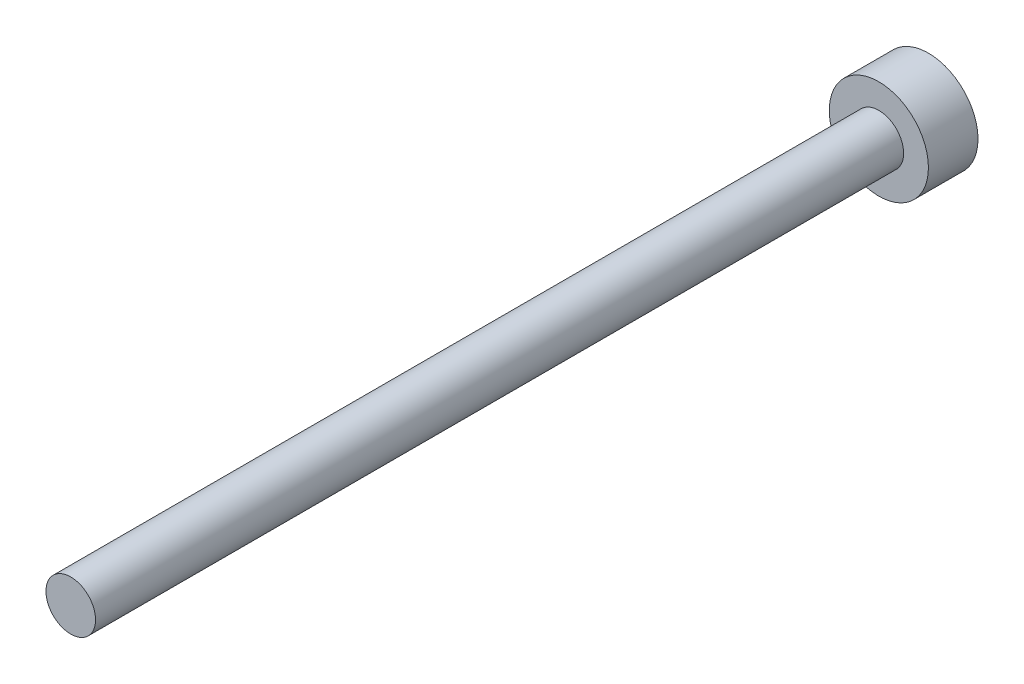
ISO-10303-21;
HEADER;
FILE_DESCRIPTION(('STEP AP214'),'2;1');
FILE_NAME('part.step','',(''),(''),'','','');
FILE_SCHEMA(('AUTOMOTIVE_DESIGN { 1 0 10303 214 1 1 1 1 }'));
ENDSEC;
DATA;
#1=APPLICATION_CONTEXT('core data for automotive mechanical design processes');
#2=APPLICATION_PROTOCOL_DEFINITION('international standard','automotive_design',2000,#1);
#3=PRODUCT_CONTEXT('',#1,'mechanical');
#4=PRODUCT('Part','Part','',(#3));
#5=PRODUCT_RELATED_PRODUCT_CATEGORY('part','',(#4));
#6=PRODUCT_DEFINITION_FORMATION('','',#4);
#7=PRODUCT_DEFINITION_CONTEXT('part definition',#1,'design');
#8=PRODUCT_DEFINITION('design','',#6,#7);
#9=PRODUCT_DEFINITION_SHAPE('','',#8);
#10=(LENGTH_UNIT() NAMED_UNIT(*) SI_UNIT(.MILLI.,.METRE.));
#11=(NAMED_UNIT(*) PLANE_ANGLE_UNIT() SI_UNIT($,.RADIAN.));
#12=(NAMED_UNIT(*) SI_UNIT($,.STERADIAN.) SOLID_ANGLE_UNIT());
#13=UNCERTAINTY_MEASURE_WITH_UNIT(LENGTH_MEASURE(1.E-05),#10,'distance_accuracy_value','');
#14=(GEOMETRIC_REPRESENTATION_CONTEXT(3) GLOBAL_UNCERTAINTY_ASSIGNED_CONTEXT((#13)) GLOBAL_UNIT_ASSIGNED_CONTEXT((#10,
#11,#12)) REPRESENTATION_CONTEXT('',''));
#15=CARTESIAN_POINT('',(0.,0.,0.));
#16=DIRECTION('',(0.,0.,1.));
#17=DIRECTION('',(1.,0.,0.));
#18=AXIS2_PLACEMENT_3D('',#15,#16,#17);
#19=CARTESIAN_POINT('',(0.,0.,2.));
#20=DIRECTION('',(0.,0.,1.));
#21=DIRECTION('',(1.,0.,0.));
#22=AXIS2_PLACEMENT_3D('',#19,#20,#21);
#23=PLANE('',#22);
#24=CARTESIAN_POINT('',(0.,0.,2.));
#25=DIRECTION('',(0.,0.,1.));
#26=DIRECTION('',(1.,0.,0.));
#27=AXIS2_PLACEMENT_3D('',#24,#25,#26);
#28=CIRCLE('',#27,2.);
#29=CARTESIAN_POINT('',(2.,0.,2.));
#30=VERTEX_POINT('',#29);
#31=EDGE_CURVE('E10',#30,#30,#28,.T.);
#32=ORIENTED_EDGE('',*,*,#31,.T.);
#33=EDGE_LOOP('',(#32));
#34=FACE_BOUND('',#33,.T.);
#35=CARTESIAN_POINT('',(0.,0.,2.));
#36=DIRECTION('',(0.,0.,1.));
#37=DIRECTION('',(1.,0.,0.));
#38=AXIS2_PLACEMENT_3D('',#35,#36,#37);
#39=CIRCLE('',#38,1.);
#40=CARTESIAN_POINT('',(1.,0.,2.));
#41=VERTEX_POINT('',#40);
#42=EDGE_CURVE('E43',#41,#41,#39,.T.);
#43=ORIENTED_EDGE('',*,*,#42,.F.);
#44=EDGE_LOOP('',(#43));
#45=FACE_BOUND('',#44,.T.);
#46=ADVANCED_FACE('F30',(#34,#45),#23,.T.);
#47=CARTESIAN_POINT('',(0.,0.,2.));
#48=DIRECTION('',(0.,0.,-1.));
#49=DIRECTION('',(-1.,0.,0.));
#50=AXIS2_PLACEMENT_3D('',#47,#48,#49);
#51=CYLINDRICAL_SURFACE('',#50,2.);
#52=ORIENTED_EDGE('',*,*,#31,.F.);
#53=EDGE_LOOP('',(#52));
#54=FACE_BOUND('',#53,.T.);
#55=CARTESIAN_POINT('',(0.,0.,0.));
#56=DIRECTION('',(0.,0.,1.));
#57=DIRECTION('',(1.,0.,0.));
#58=AXIS2_PLACEMENT_3D('',#55,#56,#57);
#59=CIRCLE('',#58,2.);
#60=CARTESIAN_POINT('',(2.,0.,0.));
#61=VERTEX_POINT('',#60);
#62=EDGE_CURVE('E34',#61,#61,#59,.T.);
#63=ORIENTED_EDGE('',*,*,#62,.T.);
#64=EDGE_LOOP('',(#63));
#65=FACE_BOUND('',#64,.T.);
#66=ADVANCED_FACE('F32',(#54,#65),#51,.T.);
#67=CARTESIAN_POINT('',(0.,0.,0.));
#68=DIRECTION('',(0.,0.,1.));
#69=DIRECTION('',(1.,0.,0.));
#70=AXIS2_PLACEMENT_3D('',#67,#68,#69);
#71=PLANE('',#70);
#72=ORIENTED_EDGE('',*,*,#62,.F.);
#73=EDGE_LOOP('',(#72));
#74=FACE_BOUND('',#73,.T.);
#75=ADVANCED_FACE('F54',(#74),#71,.F.);
#76=CARTESIAN_POINT('',(0.,0.,34.6));
#77=DIRECTION('',(0.,0.,-1.));
#78=DIRECTION('',(-1.,0.,0.));
#79=AXIS2_PLACEMENT_3D('',#76,#77,#78);
#80=CYLINDRICAL_SURFACE('',#79,1.);
#81=CARTESIAN_POINT('',(0.,0.,34.6));
#82=DIRECTION('',(0.,0.,1.));
#83=DIRECTION('',(1.,0.,0.));
#84=AXIS2_PLACEMENT_3D('',#81,#82,#83);
#85=CIRCLE('',#84,1.);
#86=CARTESIAN_POINT('',(1.,0.,34.6));
#87=VERTEX_POINT('',#86);
#88=EDGE_CURVE('E41',#87,#87,#85,.T.);
#89=ORIENTED_EDGE('',*,*,#88,.F.);
#90=EDGE_LOOP('',(#89));
#91=FACE_BOUND('',#90,.T.);
#92=ORIENTED_EDGE('',*,*,#42,.T.);
#93=EDGE_LOOP('',(#92));
#94=FACE_BOUND('',#93,.T.);
#95=ADVANCED_FACE('F51',(#91,#94),#80,.T.);
#96=CARTESIAN_POINT('',(0.,0.,34.6));
#97=DIRECTION('',(0.,0.,1.));
#98=DIRECTION('',(1.,0.,0.));
#99=AXIS2_PLACEMENT_3D('',#96,#97,#98);
#100=PLANE('',#99);
#101=ORIENTED_EDGE('',*,*,#88,.T.);
#102=EDGE_LOOP('',(#101));
#103=FACE_BOUND('',#102,.T.);
#104=ADVANCED_FACE('F49',(#103),#100,.T.);
#105=CLOSED_SHELL('',(#46,#66,#75,#95,#104));
#106=MANIFOLD_SOLID_BREP('B2',#105);
#107=ADVANCED_BREP_SHAPE_REPRESENTATION('',(#18,#106),#14);
#108=SHAPE_DEFINITION_REPRESENTATION(#9,#107);
ENDSEC;
END-ISO-10303-21;
